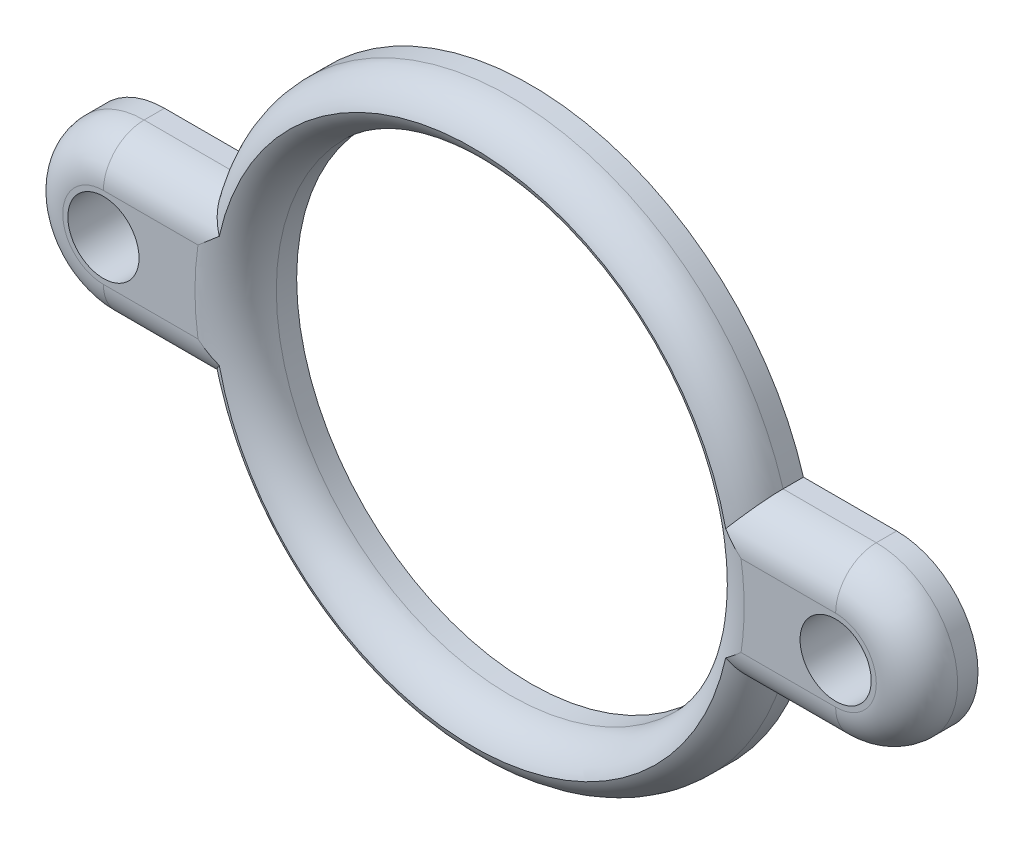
ISO-10303-21;
HEADER;
FILE_DESCRIPTION(('STEP AP214'),'2;1');
FILE_NAME('part.step','',(''),(''),'','','');
FILE_SCHEMA(('AUTOMOTIVE_DESIGN { 1 0 10303 214 1 1 1 1 }'));
ENDSEC;
DATA;
#1=APPLICATION_CONTEXT('core data for automotive mechanical design processes');
#2=APPLICATION_PROTOCOL_DEFINITION('international standard','automotive_design',2000,#1);
#3=PRODUCT_CONTEXT('',#1,'mechanical');
#4=PRODUCT('Part','Part','',(#3));
#5=PRODUCT_RELATED_PRODUCT_CATEGORY('part','',(#4));
#6=PRODUCT_DEFINITION_FORMATION('','',#4);
#7=PRODUCT_DEFINITION_CONTEXT('part definition',#1,'design');
#8=PRODUCT_DEFINITION('design','',#6,#7);
#9=PRODUCT_DEFINITION_SHAPE('','',#8);
#10=(LENGTH_UNIT() NAMED_UNIT(*) SI_UNIT(.MILLI.,.METRE.));
#11=(NAMED_UNIT(*) PLANE_ANGLE_UNIT() SI_UNIT($,.RADIAN.));
#12=(NAMED_UNIT(*) SI_UNIT($,.STERADIAN.) SOLID_ANGLE_UNIT());
#13=UNCERTAINTY_MEASURE_WITH_UNIT(LENGTH_MEASURE(1.E-05),#10,'distance_accuracy_value','');
#14=(GEOMETRIC_REPRESENTATION_CONTEXT(3) GLOBAL_UNCERTAINTY_ASSIGNED_CONTEXT((#13)) GLOBAL_UNIT_ASSIGNED_CONTEXT((#10,
#11,#12)) REPRESENTATION_CONTEXT('',''));
#15=CARTESIAN_POINT('',(0.,0.,0.));
#16=DIRECTION('',(0.,0.,1.));
#17=DIRECTION('',(1.,0.,0.));
#18=AXIS2_PLACEMENT_3D('',#15,#16,#17);
#19=CARTESIAN_POINT('',(0.,0.,3.));
#20=DIRECTION('',(0.,0.,1.));
#21=DIRECTION('',(1.,0.,0.));
#22=AXIS2_PLACEMENT_3D('',#19,#20,#21);
#23=PLANE('',#22);
#24=CARTESIAN_POINT('',(0.,0.,3.));
#25=DIRECTION('',(0.,0.,1.));
#26=DIRECTION('',(1.,0.,0.));
#27=AXIS2_PLACEMENT_3D('',#24,#25,#26);
#28=CIRCLE('',#27,13.5);
#29=CARTESIAN_POINT('',(13.3510299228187,2.00000000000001,3.));
#30=VERTEX_POINT('',#29);
#31=CARTESIAN_POINT('',(13.5,0.,3.));
#32=VERTEX_POINT('',#31);
#33=EDGE_CURVE('E377',#30,#32,#28,.F.);
#34=ORIENTED_EDGE('',*,*,#33,.T.);
#35=CARTESIAN_POINT('',(0.,0.,3.));
#36=DIRECTION('',(0.,0.,1.));
#37=DIRECTION('',(1.,0.,0.));
#38=AXIS2_PLACEMENT_3D('',#35,#36,#37);
#39=CIRCLE('',#38,13.5);
#40=CARTESIAN_POINT('',(13.3510299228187,-1.99999999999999,3.));
#41=VERTEX_POINT('',#40);
#42=EDGE_CURVE('E337',#32,#41,#39,.F.);
#43=ORIENTED_EDGE('',*,*,#42,.T.);
#44=DIRECTION('',(1.,0.,0.));
#45=VECTOR('',#44,1.);
#46=CARTESIAN_POINT('',(18.,-1.99999999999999,3.));
#47=LINE('',#46,#45);
#48=CARTESIAN_POINT('',(18.,-1.99999999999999,3.));
#49=VERTEX_POINT('',#48);
#50=EDGE_CURVE('E383',#41,#49,#47,.T.);
#51=ORIENTED_EDGE('',*,*,#50,.T.);
#52=CARTESIAN_POINT('',(18.,0.,3.));
#53=DIRECTION('',(0.,0.,1.));
#54=DIRECTION('',(1.,0.,0.));
#55=AXIS2_PLACEMENT_3D('',#52,#53,#54);
#56=CIRCLE('',#55,2.);
#57=CARTESIAN_POINT('',(18.,2.00000000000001,3.));
#58=VERTEX_POINT('',#57);
#59=EDGE_CURVE('E380',#49,#58,#56,.T.);
#60=ORIENTED_EDGE('',*,*,#59,.T.);
#61=DIRECTION('',(1.,0.,0.));
#62=VECTOR('',#61,1.);
#63=CARTESIAN_POINT('',(0.,2.,3.));
#64=LINE('',#63,#62);
#65=EDGE_CURVE('E374',#58,#30,#64,.F.);
#66=ORIENTED_EDGE('',*,*,#65,.T.);
#67=EDGE_LOOP('',(#34,#43,#51,#60,#66));
#68=FACE_BOUND('',#67,.T.);
#69=CARTESIAN_POINT('',(18.,0.,3.));
#70=DIRECTION('',(0.,0.,1.));
#71=DIRECTION('',(1.,0.,0.));
#72=AXIS2_PLACEMENT_3D('',#69,#70,#71);
#73=CIRCLE('',#72,1.75);
#74=CARTESIAN_POINT('',(19.75,0.,3.));
#75=VERTEX_POINT('',#74);
#76=EDGE_CURVE('E445',#75,#75,#73,.T.);
#77=ORIENTED_EDGE('',*,*,#76,.F.);
#78=EDGE_LOOP('',(#77));
#79=FACE_BOUND('',#78,.T.);
#80=ADVANCED_FACE('F47',(#68,#79),#23,.T.);
#81=CARTESIAN_POINT('',(18.,0.,3.));
#82=DIRECTION('',(0.,0.,-1.));
#83=DIRECTION('',(-1.,0.,0.));
#84=AXIS2_PLACEMENT_3D('',#81,#82,#83);
#85=CYLINDRICAL_SURFACE('',#84,4.);
#86=DIRECTION('',(0.,0.,-1.));
#87=VECTOR('',#86,1.);
#88=CARTESIAN_POINT('',(18.,4.00000000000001,3.));
#89=LINE('',#88,#87);
#90=CARTESIAN_POINT('',(18.,4.00000000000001,1.));
#91=VERTEX_POINT('',#90);
#92=CARTESIAN_POINT('',(18.,4.00000000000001,0.));
#93=VERTEX_POINT('',#92);
#94=EDGE_CURVE('E100',#91,#93,#89,.T.);
#95=ORIENTED_EDGE('',*,*,#94,.F.);
#96=CARTESIAN_POINT('',(18.,0.,1.));
#97=DIRECTION('',(0.,0.,1.));
#98=DIRECTION('',(1.,0.,0.));
#99=AXIS2_PLACEMENT_3D('',#96,#97,#98);
#100=CIRCLE('',#99,4.);
#101=CARTESIAN_POINT('',(18.,-3.99999999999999,1.));
#102=VERTEX_POINT('',#101);
#103=EDGE_CURVE('E336',#91,#102,#100,.F.);
#104=ORIENTED_EDGE('',*,*,#103,.T.);
#105=DIRECTION('',(0.,0.,-1.));
#106=VECTOR('',#105,1.);
#107=CARTESIAN_POINT('',(18.,-3.99999999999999,3.));
#108=LINE('',#107,#106);
#109=CARTESIAN_POINT('',(18.,-3.99999999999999,0.));
#110=VERTEX_POINT('',#109);
#111=EDGE_CURVE('E334',#102,#110,#108,.T.);
#112=ORIENTED_EDGE('',*,*,#111,.T.);
#113=CARTESIAN_POINT('',(18.,0.,0.));
#114=DIRECTION('',(0.,0.,1.));
#115=DIRECTION('',(1.,0.,0.));
#116=AXIS2_PLACEMENT_3D('',#113,#114,#115);
#117=CIRCLE('',#116,4.);
#118=EDGE_CURVE('E414',#110,#93,#117,.T.);
#119=ORIENTED_EDGE('',*,*,#118,.T.);
#120=EDGE_LOOP('',(#95,#104,#112,#119));
#121=FACE_BOUND('',#120,.T.);
#122=ADVANCED_FACE('F470',(#121),#85,.T.);
#123=CARTESIAN_POINT('',(0.,4.,3.));
#124=DIRECTION('',(0.,1.,0.));
#125=DIRECTION('',(-1.,0.,0.));
#126=AXIS2_PLACEMENT_3D('',#123,#124,#125);
#127=PLANE('',#126);
#128=DIRECTION('',(0.,0.,-1.));
#129=VECTOR('',#128,1.);
#130=CARTESIAN_POINT('',(13.4164078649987,4.00000000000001,3.));
#131=LINE('',#130,#129);
#132=CARTESIAN_POINT('',(13.4164078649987,4.00000000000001,1.));
#133=VERTEX_POINT('',#132);
#134=CARTESIAN_POINT('',(13.4164078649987,4.00000000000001,0.));
#135=VERTEX_POINT('',#134);
#136=EDGE_CURVE('E357',#133,#135,#131,.T.);
#137=ORIENTED_EDGE('',*,*,#136,.F.);
#138=DIRECTION('',(1.,0.,0.));
#139=VECTOR('',#138,1.);
#140=CARTESIAN_POINT('',(0.,4.,1.));
#141=LINE('',#140,#139);
#142=EDGE_CURVE('E207',#133,#91,#141,.T.);
#143=ORIENTED_EDGE('',*,*,#142,.T.);
#144=ORIENTED_EDGE('',*,*,#94,.T.);
#145=DIRECTION('',(1.,0.,0.));
#146=VECTOR('',#145,1.);
#147=CARTESIAN_POINT('',(0.,4.,0.));
#148=LINE('',#147,#146);
#149=EDGE_CURVE('E421',#135,#93,#148,.T.);
#150=ORIENTED_EDGE('',*,*,#149,.F.);
#151=EDGE_LOOP('',(#137,#143,#144,#150));
#152=FACE_BOUND('',#151,.T.);
#153=ADVANCED_FACE('F475',(#152),#127,.T.);
#154=CARTESIAN_POINT('',(0.,0.,3.));
#155=DIRECTION('',(0.,0.,-1.));
#156=DIRECTION('',(-1.,0.,0.));
#157=AXIS2_PLACEMENT_3D('',#154,#155,#156);
#158=CYLINDRICAL_SURFACE('',#157,14.);
#159=DIRECTION('',(0.,0.,-1.));
#160=VECTOR('',#159,1.);
#161=CARTESIAN_POINT('',(-13.4164078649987,4.,3.));
#162=LINE('',#161,#160);
#163=CARTESIAN_POINT('',(-13.4164078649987,4.,1.));
#164=VERTEX_POINT('',#163);
#165=CARTESIAN_POINT('',(-13.4164078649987,4.,0.));
#166=VERTEX_POINT('',#165);
#167=EDGE_CURVE('E185',#164,#166,#162,.T.);
#168=ORIENTED_EDGE('',*,*,#167,.F.);
#169=CARTESIAN_POINT('',(0.,0.,1.));
#170=DIRECTION('',(0.,0.,1.));
#171=DIRECTION('',(1.,0.,0.));
#172=AXIS2_PLACEMENT_3D('',#169,#170,#171);
#173=CIRCLE('',#172,14.);
#174=EDGE_CURVE('E58',#164,#133,#173,.F.);
#175=ORIENTED_EDGE('',*,*,#174,.T.);
#176=ORIENTED_EDGE('',*,*,#136,.T.);
#177=CARTESIAN_POINT('',(0.,0.,0.));
#178=DIRECTION('',(0.,0.,1.));
#179=DIRECTION('',(1.,0.,0.));
#180=AXIS2_PLACEMENT_3D('',#177,#178,#179);
#181=CIRCLE('',#180,14.);
#182=EDGE_CURVE('E425',#135,#166,#181,.T.);
#183=ORIENTED_EDGE('',*,*,#182,.T.);
#184=EDGE_LOOP('',(#168,#175,#176,#183));
#185=FACE_BOUND('',#184,.T.);
#186=ADVANCED_FACE('F489',(#185),#158,.T.);
#187=CARTESIAN_POINT('',(0.,4.,3.));
#188=DIRECTION('',(0.,1.,0.));
#189=DIRECTION('',(-1.,0.,0.));
#190=AXIS2_PLACEMENT_3D('',#187,#188,#189);
#191=PLANE('',#190);
#192=DIRECTION('',(0.,0.,-1.));
#193=VECTOR('',#192,1.);
#194=CARTESIAN_POINT('',(-18.,4.,3.));
#195=LINE('',#194,#193);
#196=CARTESIAN_POINT('',(-18.,4.,1.));
#197=VERTEX_POINT('',#196);
#198=CARTESIAN_POINT('',(-18.,4.,0.));
#199=VERTEX_POINT('',#198);
#200=EDGE_CURVE('E169',#197,#199,#195,.T.);
#201=ORIENTED_EDGE('',*,*,#200,.F.);
#202=DIRECTION('',(1.,0.,0.));
#203=VECTOR('',#202,1.);
#204=CARTESIAN_POINT('',(0.,4.,1.));
#205=LINE('',#204,#203);
#206=EDGE_CURVE('E11',#197,#164,#205,.T.);
#207=ORIENTED_EDGE('',*,*,#206,.T.);
#208=ORIENTED_EDGE('',*,*,#167,.T.);
#209=DIRECTION('',(1.,0.,0.));
#210=VECTOR('',#209,1.);
#211=CARTESIAN_POINT('',(0.,4.,0.));
#212=LINE('',#211,#210);
#213=EDGE_CURVE('E183',#199,#166,#212,.T.);
#214=ORIENTED_EDGE('',*,*,#213,.F.);
#215=EDGE_LOOP('',(#201,#207,#208,#214));
#216=FACE_BOUND('',#215,.T.);
#217=ADVANCED_FACE('F181',(#216),#191,.T.);
#218=CARTESIAN_POINT('',(-18.,0.,3.));
#219=DIRECTION('',(0.,0.,-1.));
#220=DIRECTION('',(-1.,0.,0.));
#221=AXIS2_PLACEMENT_3D('',#218,#219,#220);
#222=CYLINDRICAL_SURFACE('',#221,4.);
#223=DIRECTION('',(0.,0.,-1.));
#224=VECTOR('',#223,1.);
#225=CARTESIAN_POINT('',(-18.,-4.,3.));
#226=LINE('',#225,#224);
#227=CARTESIAN_POINT('',(-18.,-4.,1.));
#228=VERTEX_POINT('',#227);
#229=CARTESIAN_POINT('',(-18.,-4.,0.));
#230=VERTEX_POINT('',#229);
#231=EDGE_CURVE('E171',#228,#230,#226,.T.);
#232=ORIENTED_EDGE('',*,*,#231,.F.);
#233=CARTESIAN_POINT('',(-18.,0.,1.));
#234=DIRECTION('',(0.,0.,1.));
#235=DIRECTION('',(1.,0.,0.));
#236=AXIS2_PLACEMENT_3D('',#233,#234,#235);
#237=CIRCLE('',#236,4.);
#238=EDGE_CURVE('E166',#228,#197,#237,.F.);
#239=ORIENTED_EDGE('',*,*,#238,.T.);
#240=ORIENTED_EDGE('',*,*,#200,.T.);
#241=CARTESIAN_POINT('',(-18.,0.,0.));
#242=DIRECTION('',(0.,0.,1.));
#243=DIRECTION('',(1.,0.,0.));
#244=AXIS2_PLACEMENT_3D('',#241,#242,#243);
#245=CIRCLE('',#244,4.);
#246=EDGE_CURVE('E431',#199,#230,#245,.T.);
#247=ORIENTED_EDGE('',*,*,#246,.T.);
#248=EDGE_LOOP('',(#232,#239,#240,#247));
#249=FACE_BOUND('',#248,.T.);
#250=ADVANCED_FACE('F167',(#249),#222,.T.);
#251=CARTESIAN_POINT('',(0.,-4.,3.));
#252=DIRECTION('',(0.,1.,0.));
#253=DIRECTION('',(-1.,0.,0.));
#254=AXIS2_PLACEMENT_3D('',#251,#252,#253);
#255=PLANE('',#254);
#256=DIRECTION('',(0.,0.,-1.));
#257=VECTOR('',#256,1.);
#258=CARTESIAN_POINT('',(-13.4164078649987,-4.,3.));
#259=LINE('',#258,#257);
#260=CARTESIAN_POINT('',(-13.4164078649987,-4.,1.));
#261=VERTEX_POINT('',#260);
#262=CARTESIAN_POINT('',(-13.4164078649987,-4.,0.));
#263=VERTEX_POINT('',#262);
#264=EDGE_CURVE('E344',#261,#263,#259,.T.);
#265=ORIENTED_EDGE('',*,*,#264,.F.);
#266=DIRECTION('',(1.,0.,0.));
#267=VECTOR('',#266,1.);
#268=CARTESIAN_POINT('',(-18.,-4.,1.));
#269=LINE('',#268,#267);
#270=EDGE_CURVE('E178',#261,#228,#269,.F.);
#271=ORIENTED_EDGE('',*,*,#270,.T.);
#272=ORIENTED_EDGE('',*,*,#231,.T.);
#273=DIRECTION('',(1.,0.,0.));
#274=VECTOR('',#273,1.);
#275=CARTESIAN_POINT('',(0.,-4.,0.));
#276=LINE('',#275,#274);
#277=EDGE_CURVE('E434',#230,#263,#276,.T.);
#278=ORIENTED_EDGE('',*,*,#277,.T.);
#279=EDGE_LOOP('',(#265,#271,#272,#278));
#280=FACE_BOUND('',#279,.T.);
#281=ADVANCED_FACE('F520',(#280),#255,.F.);
#282=CARTESIAN_POINT('',(0.,0.,3.));
#283=DIRECTION('',(0.,0.,-1.));
#284=DIRECTION('',(-1.,0.,0.));
#285=AXIS2_PLACEMENT_3D('',#282,#283,#284);
#286=CYLINDRICAL_SURFACE('',#285,14.);
#287=DIRECTION('',(0.,0.,-1.));
#288=VECTOR('',#287,1.);
#289=CARTESIAN_POINT('',(13.4164078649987,-3.99999999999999,3.));
#290=LINE('',#289,#288);
#291=CARTESIAN_POINT('',(13.4164078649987,-3.99999999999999,1.));
#292=VERTEX_POINT('',#291);
#293=CARTESIAN_POINT('',(13.4164078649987,-3.99999999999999,0.));
#294=VERTEX_POINT('',#293);
#295=EDGE_CURVE('E332',#292,#294,#290,.T.);
#296=ORIENTED_EDGE('',*,*,#295,.F.);
#297=CARTESIAN_POINT('',(0.,0.,1.));
#298=DIRECTION('',(0.,0.,1.));
#299=DIRECTION('',(1.,0.,0.));
#300=AXIS2_PLACEMENT_3D('',#297,#298,#299);
#301=CIRCLE('',#300,14.);
#302=EDGE_CURVE('E210',#292,#261,#301,.F.);
#303=ORIENTED_EDGE('',*,*,#302,.T.);
#304=ORIENTED_EDGE('',*,*,#264,.T.);
#305=CARTESIAN_POINT('',(0.,0.,0.));
#306=DIRECTION('',(0.,0.,1.));
#307=DIRECTION('',(1.,0.,0.));
#308=AXIS2_PLACEMENT_3D('',#305,#306,#307);
#309=CIRCLE('',#308,14.);
#310=EDGE_CURVE('E341',#263,#294,#309,.T.);
#311=ORIENTED_EDGE('',*,*,#310,.T.);
#312=EDGE_LOOP('',(#296,#303,#304,#311));
#313=FACE_BOUND('',#312,.T.);
#314=ADVANCED_FACE('F339',(#313),#286,.T.);
#315=CARTESIAN_POINT('',(0.,-4.,3.));
#316=DIRECTION('',(0.,1.,0.));
#317=DIRECTION('',(-1.,0.,0.));
#318=AXIS2_PLACEMENT_3D('',#315,#316,#317);
#319=PLANE('',#318);
#320=ORIENTED_EDGE('',*,*,#111,.F.);
#321=DIRECTION('',(1.,0.,0.));
#322=VECTOR('',#321,1.);
#323=CARTESIAN_POINT('',(13.4164078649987,-3.99999999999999,1.));
#324=LINE('',#323,#322);
#325=EDGE_CURVE('E320',#102,#292,#324,.F.);
#326=ORIENTED_EDGE('',*,*,#325,.T.);
#327=ORIENTED_EDGE('',*,*,#295,.T.);
#328=DIRECTION('',(1.,0.,0.));
#329=VECTOR('',#328,1.);
#330=CARTESIAN_POINT('',(0.,-4.,0.));
#331=LINE('',#330,#329);
#332=EDGE_CURVE('E440',#294,#110,#331,.T.);
#333=ORIENTED_EDGE('',*,*,#332,.T.);
#334=EDGE_LOOP('',(#320,#326,#327,#333));
#335=FACE_BOUND('',#334,.T.);
#336=ADVANCED_FACE('F330',(#335),#319,.F.);
#337=CARTESIAN_POINT('',(18.,0.,3.));
#338=DIRECTION('',(0.,0.,-1.));
#339=DIRECTION('',(-1.,0.,0.));
#340=AXIS2_PLACEMENT_3D('',#337,#338,#339);
#341=CYLINDRICAL_SURFACE('',#340,1.75);
#342=ORIENTED_EDGE('',*,*,#76,.T.);
#343=EDGE_LOOP('',(#342));
#344=FACE_BOUND('',#343,.T.);
#345=CARTESIAN_POINT('',(18.,0.,0.));
#346=DIRECTION('',(0.,0.,1.));
#347=DIRECTION('',(1.,0.,0.));
#348=AXIS2_PLACEMENT_3D('',#345,#346,#347);
#349=CIRCLE('',#348,1.75);
#350=CARTESIAN_POINT('',(19.75,0.,0.));
#351=VERTEX_POINT('',#350);
#352=EDGE_CURVE('E408',#351,#351,#349,.T.);
#353=ORIENTED_EDGE('',*,*,#352,.F.);
#354=EDGE_LOOP('',(#353));
#355=FACE_BOUND('',#354,.T.);
#356=ADVANCED_FACE('F500',(#344,#355),#341,.F.);
#357=CARTESIAN_POINT('',(0.,0.,3.));
#358=DIRECTION('',(0.,0.,-1.));
#359=DIRECTION('',(-1.,0.,0.));
#360=AXIS2_PLACEMENT_3D('',#357,#358,#359);
#361=CYLINDRICAL_SURFACE('',#360,11.5);
#362=CARTESIAN_POINT('',(0.,0.,1.));
#363=DIRECTION('',(0.,0.,1.));
#364=DIRECTION('',(1.,0.,0.));
#365=AXIS2_PLACEMENT_3D('',#362,#363,#364);
#366=CIRCLE('',#365,11.5);
#367=CARTESIAN_POINT('',(11.5,0.,1.));
#368=VERTEX_POINT('',#367);
#369=EDGE_CURVE('E177',#368,#368,#366,.T.);
#370=ORIENTED_EDGE('',*,*,#369,.T.);
#371=EDGE_LOOP('',(#370));
#372=FACE_BOUND('',#371,.T.);
#373=CARTESIAN_POINT('',(0.,0.,0.));
#374=DIRECTION('',(0.,0.,1.));
#375=DIRECTION('',(1.,0.,0.));
#376=AXIS2_PLACEMENT_3D('',#373,#374,#375);
#377=CIRCLE('',#376,11.5);
#378=CARTESIAN_POINT('',(11.5,0.,0.));
#379=VERTEX_POINT('',#378);
#380=EDGE_CURVE('E405',#379,#379,#377,.T.);
#381=ORIENTED_EDGE('',*,*,#380,.F.);
#382=EDGE_LOOP('',(#381));
#383=FACE_BOUND('',#382,.T.);
#384=ADVANCED_FACE('F397',(#372,#383),#361,.F.);
#385=CARTESIAN_POINT('',(-18.,0.,3.));
#386=DIRECTION('',(0.,0.,-1.));
#387=DIRECTION('',(-1.,0.,0.));
#388=AXIS2_PLACEMENT_3D('',#385,#386,#387);
#389=CYLINDRICAL_SURFACE('',#388,1.75);
#390=CARTESIAN_POINT('',(-18.,0.,3.));
#391=DIRECTION('',(0.,0.,1.));
#392=DIRECTION('',(1.,0.,0.));
#393=AXIS2_PLACEMENT_3D('',#390,#391,#392);
#394=CIRCLE('',#393,1.75);
#395=CARTESIAN_POINT('',(-16.25,0.,3.));
#396=VERTEX_POINT('',#395);
#397=EDGE_CURVE('E349',#396,#396,#394,.T.);
#398=ORIENTED_EDGE('',*,*,#397,.T.);
#399=EDGE_LOOP('',(#398));
#400=FACE_BOUND('',#399,.T.);
#401=CARTESIAN_POINT('',(-18.,0.,0.));
#402=DIRECTION('',(0.,0.,1.));
#403=DIRECTION('',(1.,0.,0.));
#404=AXIS2_PLACEMENT_3D('',#401,#402,#403);
#405=CIRCLE('',#404,1.75);
#406=CARTESIAN_POINT('',(-16.25,0.,0.));
#407=VERTEX_POINT('',#406);
#408=EDGE_CURVE('E442',#407,#407,#405,.T.);
#409=ORIENTED_EDGE('',*,*,#408,.F.);
#410=EDGE_LOOP('',(#409));
#411=FACE_BOUND('',#410,.T.);
#412=ADVANCED_FACE('F456',(#400,#411),#389,.F.);
#413=CARTESIAN_POINT('',(-18.,0.,3.));
#414=DIRECTION('',(0.,0.,1.));
#415=DIRECTION('',(1.,0.,0.));
#416=AXIS2_PLACEMENT_3D('',#413,#414,#415);
#417=CIRCLE('',#416,2.);
#418=CARTESIAN_POINT('',(-18.,2.,3.));
#419=VERTEX_POINT('',#418);
#420=CARTESIAN_POINT('',(-18.,-2.,3.));
#421=VERTEX_POINT('',#420);
#422=EDGE_CURVE('E190',#419,#421,#417,.T.);
#423=ORIENTED_EDGE('',*,*,#422,.T.);
#424=DIRECTION('',(1.,0.,0.));
#425=VECTOR('',#424,1.);
#426=CARTESIAN_POINT('',(-13.4164078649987,-2.,3.));
#427=LINE('',#426,#425);
#428=CARTESIAN_POINT('',(-13.3510299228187,-2.,3.));
#429=VERTEX_POINT('',#428);
#430=EDGE_CURVE('E370',#421,#429,#427,.T.);
#431=ORIENTED_EDGE('',*,*,#430,.T.);
#432=CARTESIAN_POINT('',(0.,0.,3.));
#433=DIRECTION('',(0.,0.,1.));
#434=DIRECTION('',(1.,0.,0.));
#435=AXIS2_PLACEMENT_3D('',#432,#433,#434);
#436=CIRCLE('',#435,13.5);
#437=CARTESIAN_POINT('',(-13.3510299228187,2.,3.));
#438=VERTEX_POINT('',#437);
#439=EDGE_CURVE('E365',#429,#438,#436,.F.);
#440=ORIENTED_EDGE('',*,*,#439,.T.);
#441=DIRECTION('',(1.,0.,0.));
#442=VECTOR('',#441,1.);
#443=CARTESIAN_POINT('',(0.,2.,3.));
#444=LINE('',#443,#442);
#445=EDGE_CURVE('E362',#438,#419,#444,.F.);
#446=ORIENTED_EDGE('',*,*,#445,.T.);
#447=EDGE_LOOP('',(#423,#431,#440,#446));
#448=FACE_BOUND('',#447,.T.);
#449=ORIENTED_EDGE('',*,*,#397,.F.);
#450=EDGE_LOOP('',(#449));
#451=FACE_BOUND('',#450,.T.);
#452=ADVANCED_FACE('F402',(#448,#451),#23,.T.);
#453=CARTESIAN_POINT('',(0.,0.,0.));
#454=DIRECTION('',(0.,0.,1.));
#455=DIRECTION('',(1.,0.,0.));
#456=AXIS2_PLACEMENT_3D('',#453,#454,#455);
#457=PLANE('',#456);
#458=ORIENTED_EDGE('',*,*,#380,.T.);
#459=EDGE_LOOP('',(#458));
#460=FACE_BOUND('',#459,.T.);
#461=ORIENTED_EDGE('',*,*,#352,.T.);
#462=EDGE_LOOP('',(#461));
#463=FACE_BOUND('',#462,.T.);
#464=ORIENTED_EDGE('',*,*,#118,.F.);
#465=ORIENTED_EDGE('',*,*,#332,.F.);
#466=ORIENTED_EDGE('',*,*,#310,.F.);
#467=ORIENTED_EDGE('',*,*,#277,.F.);
#468=ORIENTED_EDGE('',*,*,#246,.F.);
#469=ORIENTED_EDGE('',*,*,#213,.T.);
#470=ORIENTED_EDGE('',*,*,#182,.F.);
#471=ORIENTED_EDGE('',*,*,#149,.T.);
#472=EDGE_LOOP('',(#464,#465,#466,#467,#468,#469,#470,#471));
#473=FACE_BOUND('',#472,.T.);
#474=ORIENTED_EDGE('',*,*,#408,.T.);
#475=EDGE_LOOP('',(#474));
#476=FACE_BOUND('',#475,.T.);
#477=ADVANCED_FACE('F459',(#460,#463,#473,#476),#457,.F.);
#478=CARTESIAN_POINT('',(-18.,0.,1.));
#479=DIRECTION('',(0.,0.,1.));
#480=DIRECTION('',(1.,0.,0.));
#481=AXIS2_PLACEMENT_3D('',#478,#479,#480);
#482=DEGENERATE_TOROIDAL_SURFACE('',#481,2.,2.,.T.);
#483=CARTESIAN_POINT('',(-18.,2.,1.));
#484=DIRECTION('',(1.,0.,0.));
#485=DIRECTION('',(0.,0.,-1.));
#486=AXIS2_PLACEMENT_3D('',#483,#484,#485);
#487=CIRCLE('',#486,2.);
#488=EDGE_CURVE('E189',#197,#419,#487,.T.);
#489=ORIENTED_EDGE('',*,*,#488,.F.);
#490=ORIENTED_EDGE('',*,*,#238,.F.);
#491=CARTESIAN_POINT('',(-18.,-2.,1.));
#492=DIRECTION('',(1.,0.,0.));
#493=DIRECTION('',(0.,0.,-1.));
#494=AXIS2_PLACEMENT_3D('',#491,#492,#493);
#495=CIRCLE('',#494,2.);
#496=EDGE_CURVE('E51',#421,#228,#495,.T.);
#497=ORIENTED_EDGE('',*,*,#496,.F.);
#498=ORIENTED_EDGE('',*,*,#422,.F.);
#499=EDGE_LOOP('',(#489,#490,#497,#498));
#500=FACE_BOUND('',#499,.T.);
#501=ADVANCED_FACE('F49',(#500),#482,.T.);
#502=CARTESIAN_POINT('',(0.,-2.,1.));
#503=DIRECTION('',(-1.,0.,0.));
#504=DIRECTION('',(0.,-1.,0.));
#505=AXIS2_PLACEMENT_3D('',#502,#503,#504);
#506=CYLINDRICAL_SURFACE('',#505,2.);
#507=ORIENTED_EDGE('',*,*,#496,.T.);
#508=ORIENTED_EDGE('',*,*,#270,.F.);
#509=CARTESIAN_POINT('',(-13.4164078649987,-4.,1.));
#510=CARTESIAN_POINT('',(-13.416414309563,-4.00000968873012,1.04819069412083));
#511=CARTESIAN_POINT('',(-13.4151098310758,-3.99825852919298,1.09637547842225));
#512=CARTESIAN_POINT('',(-13.4099285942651,-3.99130863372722,1.19233521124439));
#513=CARTESIAN_POINT('',(-13.4060530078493,-3.98611146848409,1.24011033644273));
#514=CARTESIAN_POINT('',(-13.395807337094,-3.97238147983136,1.33463624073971));
#515=CARTESIAN_POINT('',(-13.3894511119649,-3.96386718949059,1.38139121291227));
#516=CARTESIAN_POINT('',(-13.3743393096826,-3.94364475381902,1.47379906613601));
#517=CARTESIAN_POINT('',(-13.3655835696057,-3.93193639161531,1.51945187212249));
#518=CARTESIAN_POINT('',(-13.3359080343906,-3.89230243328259,1.65415475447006));
#519=CARTESIAN_POINT('',(-13.3115549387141,-3.85983432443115,1.741173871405));
#520=CARTESIAN_POINT('',(-13.2548263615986,-3.78448106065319,1.90775470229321));
#521=CARTESIAN_POINT('',(-13.2224418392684,-3.74158416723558,1.98730787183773));
#522=CARTESIAN_POINT('',(-13.148536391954,-3.64412803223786,2.14271232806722));
#523=CARTESIAN_POINT('',(-13.1065556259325,-3.58898852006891,2.21797884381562));
#524=CARTESIAN_POINT('',(-13.0163151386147,-3.47112090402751,2.35801229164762));
#525=CARTESIAN_POINT('',(-12.968052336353,-3.40838907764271,2.42277403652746));
#526=CARTESIAN_POINT('',(-12.8437315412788,-3.24780311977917,2.56824676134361));
#527=CARTESIAN_POINT('',(-12.7648988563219,-3.14679246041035,2.64312955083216));
#528=CARTESIAN_POINT('',(-12.5996945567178,-2.93727251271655,2.77105752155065));
#529=CARTESIAN_POINT('',(-12.5133077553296,-2.82874821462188,2.82405742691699));
#530=CARTESIAN_POINT('',(-12.3307177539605,-2.60189130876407,2.9113556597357));
#531=CARTESIAN_POINT('',(-12.2342365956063,-2.48334471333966,2.94449996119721));
#532=CARTESIAN_POINT('',(-12.0380319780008,-2.24523082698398,2.98858760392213));
#533=CARTESIAN_POINT('',(-11.9383161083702,-2.12566635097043,2.99957956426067));
#534=CARTESIAN_POINT('',(-11.8360354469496,-2.00458656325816,2.99999605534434));
#535=CARTESIAN_POINT('',(-11.834097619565,-2.00229313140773,2.99999999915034));
#536=CARTESIAN_POINT('',(-11.8321595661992,-2.,3.));
#537=B_SPLINE_CURVE_WITH_KNOTS('',3,(#509,#510,#511,#512,#513,#514,#515,#516,#517,#518,#519,
#520,#521,#522,#523,#524,#525,#526,#527,#528,#529,#530,#531,#532,#533,#534,#535,#536),
.UNSPECIFIED.,.F.,.F.,(4,2,2,2,2,2,2,2,2,2,2,2,2,4),(0.,0.144512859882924,0.28895989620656,
0.432611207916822,0.576272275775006,0.862917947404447,1.14988776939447,1.4556743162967,
1.76161140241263,2.20443005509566,2.64816036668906,3.11566288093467,3.5821382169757,
3.59114571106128),.UNSPECIFIED.);
#538=CARTESIAN_POINT('',(-12.4498995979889,-2.74999999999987,2.85404962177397));
#539=VERTEX_POINT('',#538);
#540=EDGE_CURVE('E91',#539,#261,#537,.F.);
#541=ORIENTED_EDGE('',*,*,#540,.F.);
#542=CARTESIAN_POINT('',(-11.680963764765,-3.34855114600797,2.47695964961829));
#543=CARTESIAN_POINT('',(-11.7211327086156,-3.31827996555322,2.50459319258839));
#544=CARTESIAN_POINT('',(-11.7617559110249,-3.28750912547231,2.53098889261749));
#545=CARTESIAN_POINT('',(-11.8437592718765,-3.22506592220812,2.58140032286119));
#546=CARTESIAN_POINT('',(-11.8851392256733,-3.19339380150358,2.60541668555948));
#547=CARTESIAN_POINT('',(-12.0101392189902,-3.09720929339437,2.67401725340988));
#548=CARTESIAN_POINT('',(-12.0946972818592,-3.03147012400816,2.71520574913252));
#549=CARTESIAN_POINT('',(-12.265190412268,-2.89749554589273,2.78894771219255));
#550=CARTESIAN_POINT('',(-12.3511219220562,-2.82926613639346,2.8215205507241));
#551=CARTESIAN_POINT('',(-12.5239178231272,-2.69061124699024,2.87847576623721));
#552=CARTESIAN_POINT('',(-12.6107822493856,-2.62018568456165,2.90285783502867));
#553=CARTESIAN_POINT('',(-12.8055844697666,-2.4606002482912,2.94840345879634));
#554=CARTESIAN_POINT('',(-12.9136312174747,-2.37096070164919,2.96743004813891));
#555=CARTESIAN_POINT('',(-13.1293889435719,-2.18970222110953,2.99308218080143));
#556=CARTESIAN_POINT('',(-13.237100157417,-2.09808550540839,2.99972095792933));
#557=CARTESIAN_POINT('',(-13.3464866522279,-2.00391287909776,2.99999712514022));
#558=CARTESIAN_POINT('',(-13.3487584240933,-2.00195657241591,2.99999999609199));
#559=CARTESIAN_POINT('',(-13.3510299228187,-2.,3.));
#560=B_SPLINE_CURVE_WITH_KNOTS('',3,(#542,#543,#544,#545,#546,#547,#548,#549,#550,#551,#552,
#553,#554,#555,#556,#557,#558,#559),.UNSPECIFIED.,.F.,.F.,(4,2,2,2,2,2,2,2,4),(0.,
0.172125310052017,0.344204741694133,0.688032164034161,1.03107983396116,1.3741404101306,
1.79861451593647,2.22263489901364,2.23162893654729),.UNSPECIFIED.);
#561=EDGE_CURVE('E279',#429,#539,#560,.F.);
#562=ORIENTED_EDGE('',*,*,#561,.F.);
#563=ORIENTED_EDGE('',*,*,#430,.F.);
#564=EDGE_LOOP('',(#507,#508,#541,#562,#563));
#565=FACE_BOUND('',#564,.T.);
#566=ADVANCED_FACE('F270',(#565),#506,.T.);
#567=CARTESIAN_POINT('',(0.,2.,1.));
#568=DIRECTION('',(1.,0.,0.));
#569=DIRECTION('',(0.,1.,0.));
#570=AXIS2_PLACEMENT_3D('',#567,#568,#569);
#571=CYLINDRICAL_SURFACE('',#570,2.);
#572=CARTESIAN_POINT('',(-13.4164078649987,4.,1.));
#573=CARTESIAN_POINT('',(-13.416414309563,4.00000968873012,1.04819069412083));
#574=CARTESIAN_POINT('',(-13.4151098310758,3.99825852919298,1.09637547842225));
#575=CARTESIAN_POINT('',(-13.4099285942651,3.99130863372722,1.19233521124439));
#576=CARTESIAN_POINT('',(-13.4060530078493,3.98611146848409,1.24011033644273));
#577=CARTESIAN_POINT('',(-13.395807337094,3.97238147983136,1.33463624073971));
#578=CARTESIAN_POINT('',(-13.3894511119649,3.96386718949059,1.38139121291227));
#579=CARTESIAN_POINT('',(-13.3743393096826,3.94364475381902,1.47379906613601));
#580=CARTESIAN_POINT('',(-13.3655835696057,3.93193639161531,1.51945187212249));
#581=CARTESIAN_POINT('',(-13.3359080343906,3.89230243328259,1.65415475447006));
#582=CARTESIAN_POINT('',(-13.3115549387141,3.85983432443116,1.741173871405));
#583=CARTESIAN_POINT('',(-13.2548263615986,3.7844810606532,1.90775470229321));
#584=CARTESIAN_POINT('',(-13.2224418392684,3.74158416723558,1.98730787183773));
#585=CARTESIAN_POINT('',(-13.148536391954,3.64412803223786,2.14271232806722));
#586=CARTESIAN_POINT('',(-13.1065556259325,3.58898852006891,2.21797884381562));
#587=CARTESIAN_POINT('',(-13.0163151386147,3.47112090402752,2.35801229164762));
#588=CARTESIAN_POINT('',(-12.968052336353,3.40838907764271,2.42277403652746));
#589=CARTESIAN_POINT('',(-12.8437315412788,3.24780311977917,2.5682467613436));
#590=CARTESIAN_POINT('',(-12.7648988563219,3.14679246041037,2.64312955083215));
#591=CARTESIAN_POINT('',(-12.5996945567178,2.93727251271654,2.77105752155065));
#592=CARTESIAN_POINT('',(-12.5133077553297,2.82874821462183,2.82405742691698));
#593=CARTESIAN_POINT('',(-12.3307177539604,2.60189130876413,2.9113556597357));
#594=CARTESIAN_POINT('',(-12.234236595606,2.48334471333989,2.94449996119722));
#595=CARTESIAN_POINT('',(-12.038031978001,2.24523082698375,2.98858760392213));
#596=CARTESIAN_POINT('',(-11.9383161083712,2.12566635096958,2.99957956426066));
#597=CARTESIAN_POINT('',(-11.8360354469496,2.00458656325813,2.99999605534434));
#598=CARTESIAN_POINT('',(-11.834097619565,2.00229313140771,2.99999999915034));
#599=CARTESIAN_POINT('',(-11.8321595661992,2.,3.));
#600=B_SPLINE_CURVE_WITH_KNOTS('',3,(#572,#573,#574,#575,#576,#577,#578,#579,#580,#581,#582,
#583,#584,#585,#586,#587,#588,#589,#590,#591,#592,#593,#594,#595,#596,#597,#598,#599),
.UNSPECIFIED.,.F.,.F.,(4,2,2,2,2,2,2,2,2,2,2,2,2,4),(0.,0.144512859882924,0.28895989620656,
0.432611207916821,0.576272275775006,0.862917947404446,1.14988776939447,1.4556743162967,
1.76161140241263,2.20443005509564,2.64816036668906,3.11566288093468,3.58213821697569,
3.59114571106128),.UNSPECIFIED.);
#601=CARTESIAN_POINT('',(-12.4498995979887,2.75000000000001,2.85404962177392));
#602=VERTEX_POINT('',#601);
#603=EDGE_CURVE('E83',#164,#602,#600,.T.);
#604=ORIENTED_EDGE('',*,*,#603,.F.);
#605=ORIENTED_EDGE('',*,*,#206,.F.);
#606=ORIENTED_EDGE('',*,*,#488,.T.);
#607=ORIENTED_EDGE('',*,*,#445,.F.);
#608=CARTESIAN_POINT('',(-11.680963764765,3.34855114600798,2.47695964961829));
#609=CARTESIAN_POINT('',(-11.7211327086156,3.31827996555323,2.50459319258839));
#610=CARTESIAN_POINT('',(-11.7617559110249,3.28750912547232,2.53098889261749));
#611=CARTESIAN_POINT('',(-11.8437592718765,3.22506592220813,2.58140032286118));
#612=CARTESIAN_POINT('',(-11.8851392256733,3.19339380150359,2.60541668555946));
#613=CARTESIAN_POINT('',(-12.0101392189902,3.0972092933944,2.67401725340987));
#614=CARTESIAN_POINT('',(-12.0946972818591,3.0314701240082,2.7152057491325));
#615=CARTESIAN_POINT('',(-12.265190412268,2.89749554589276,2.78894771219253));
#616=CARTESIAN_POINT('',(-12.3511219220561,2.82926613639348,2.82152055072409));
#617=CARTESIAN_POINT('',(-12.5239178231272,2.69061124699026,2.87847576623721));
#618=CARTESIAN_POINT('',(-12.6107822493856,2.62018568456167,2.90285783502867));
#619=CARTESIAN_POINT('',(-12.8055844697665,2.46060024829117,2.94840345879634));
#620=CARTESIAN_POINT('',(-12.9136312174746,2.37096070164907,2.96743004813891));
#621=CARTESIAN_POINT('',(-13.129388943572,2.18970222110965,2.99308218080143));
#622=CARTESIAN_POINT('',(-13.2371001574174,2.09808550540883,2.99972095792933));
#623=CARTESIAN_POINT('',(-13.3464866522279,2.00391287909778,2.99999712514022));
#624=CARTESIAN_POINT('',(-13.3487584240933,2.00195657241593,2.99999999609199));
#625=CARTESIAN_POINT('',(-13.3510299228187,2.,3.));
#626=B_SPLINE_CURVE_WITH_KNOTS('',3,(#608,#609,#610,#611,#612,#613,#614,#615,#616,#617,#618,
#619,#620,#621,#622,#623,#624,#625),.UNSPECIFIED.,.F.,.F.,(4,2,2,2,2,2,2,2,4),(0.,
0.172125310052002,0.344204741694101,0.688032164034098,1.03107983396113,1.3741404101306,
1.79861451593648,2.22263489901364,2.23162893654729),.UNSPECIFIED.);
#627=EDGE_CURVE('E196',#602,#438,#626,.T.);
#628=ORIENTED_EDGE('',*,*,#627,.F.);
#629=EDGE_LOOP('',(#604,#605,#606,#607,#628));
#630=FACE_BOUND('',#629,.T.);
#631=ADVANCED_FACE('F194',(#630),#571,.T.);
#632=CARTESIAN_POINT('',(0.,0.,1.));
#633=DIRECTION('',(0.,0.,1.));
#634=DIRECTION('',(1.,0.,0.));
#635=AXIS2_PLACEMENT_3D('',#632,#633,#634);
#636=TOROIDAL_SURFACE('',#635,12.,2.);
#637=CARTESIAN_POINT('',(13.4164078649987,4.00000000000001,1.));
#638=CARTESIAN_POINT('',(13.416414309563,4.00000968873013,1.04819069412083));
#639=CARTESIAN_POINT('',(13.4151098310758,3.99825852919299,1.09637547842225));
#640=CARTESIAN_POINT('',(13.4099285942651,3.99130863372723,1.19233521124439));
#641=CARTESIAN_POINT('',(13.4060530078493,3.9861114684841,1.24011033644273));
#642=CARTESIAN_POINT('',(13.395807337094,3.97238147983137,1.33463624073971));
#643=CARTESIAN_POINT('',(13.3894511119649,3.96386718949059,1.38139121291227));
#644=CARTESIAN_POINT('',(13.3743393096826,3.94364475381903,1.47379906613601));
#645=CARTESIAN_POINT('',(13.3655835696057,3.93193639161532,1.51945187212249));
#646=CARTESIAN_POINT('',(13.3359080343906,3.89230243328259,1.65415475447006));
#647=CARTESIAN_POINT('',(13.3115549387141,3.85983432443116,1.741173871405));
#648=CARTESIAN_POINT('',(13.2548263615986,3.7844810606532,1.90775470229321));
#649=CARTESIAN_POINT('',(13.2224418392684,3.74158416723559,1.98730787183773));
#650=CARTESIAN_POINT('',(13.148536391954,3.64412803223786,2.14271232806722));
#651=CARTESIAN_POINT('',(13.1065556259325,3.58898852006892,2.21797884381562));
#652=CARTESIAN_POINT('',(13.0163151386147,3.47112090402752,2.35801229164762));
#653=CARTESIAN_POINT('',(12.968052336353,3.40838907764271,2.42277403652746));
#654=CARTESIAN_POINT('',(12.8437315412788,3.24780311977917,2.56824676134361));
#655=CARTESIAN_POINT('',(12.7648988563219,3.14679246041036,2.64312955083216));
#656=CARTESIAN_POINT('',(12.5996945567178,2.93727251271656,2.77105752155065));
#657=CARTESIAN_POINT('',(12.5133077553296,2.82874821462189,2.82405742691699));
#658=CARTESIAN_POINT('',(12.3307177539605,2.60189130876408,2.9113556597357));
#659=CARTESIAN_POINT('',(12.2342365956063,2.48334471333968,2.94449996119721));
#660=CARTESIAN_POINT('',(12.0380319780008,2.24523082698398,2.98858760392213));
#661=CARTESIAN_POINT('',(11.9383161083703,2.12566635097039,2.99957956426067));
#662=CARTESIAN_POINT('',(11.8360354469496,2.00458656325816,2.99999605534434));
#663=CARTESIAN_POINT('',(11.834097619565,2.00229313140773,2.99999999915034));
#664=CARTESIAN_POINT('',(11.8321595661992,2.,3.));
#665=B_SPLINE_CURVE_WITH_KNOTS('',3,(#637,#638,#639,#640,#641,#642,#643,#644,#645,#646,#647,
#648,#649,#650,#651,#652,#653,#654,#655,#656,#657,#658,#659,#660,#661,#662,#663,#664),
.UNSPECIFIED.,.F.,.F.,(4,2,2,2,2,2,2,2,2,2,2,2,2,4),(0.,0.144512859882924,0.28895989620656,
0.432611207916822,0.576272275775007,0.862917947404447,1.14988776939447,1.4556743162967,
1.76161140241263,2.20443005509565,2.64816036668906,3.11566288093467,3.58213821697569,
3.59114571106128),.UNSPECIFIED.);
#666=CARTESIAN_POINT('',(12.4498995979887,2.75,2.85404962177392));
#667=VERTEX_POINT('',#666);
#668=EDGE_CURVE('E199',#133,#667,#665,.T.);
#669=ORIENTED_EDGE('',*,*,#668,.F.);
#670=ORIENTED_EDGE('',*,*,#174,.F.);
#671=ORIENTED_EDGE('',*,*,#603,.T.);
#672=CARTESIAN_POINT('',(0.,0.,2.85404962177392));
#673=DIRECTION('',(0.,0.,1.));
#674=DIRECTION('',(1.,0.,0.));
#675=AXIS2_PLACEMENT_3D('',#672,#673,#674);
#676=CIRCLE('',#675,12.75);
#677=EDGE_CURVE('E293',#667,#602,#676,.T.);
#678=ORIENTED_EDGE('',*,*,#677,.F.);
#679=EDGE_LOOP('',(#669,#670,#671,#678));
#680=FACE_BOUND('',#679,.T.);
#681=ADVANCED_FACE('F202',(#680),#636,.T.);
#682=CARTESIAN_POINT('',(0.,2.,1.));
#683=DIRECTION('',(1.,0.,0.));
#684=DIRECTION('',(0.,1.,0.));
#685=AXIS2_PLACEMENT_3D('',#682,#683,#684);
#686=CYLINDRICAL_SURFACE('',#685,2.);
#687=ORIENTED_EDGE('',*,*,#142,.F.);
#688=ORIENTED_EDGE('',*,*,#668,.T.);
#689=CARTESIAN_POINT('',(13.3510299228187,2.,3.));
#690=CARTESIAN_POINT('',(13.3487584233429,2.00195657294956,2.99999999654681));
#691=CARTESIAN_POINT('',(13.3464866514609,2.00391287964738,2.99999712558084));
#692=CARTESIAN_POINT('',(13.2431914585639,2.09284140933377,2.99973631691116));
#693=CARTESIAN_POINT('',(13.1416390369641,2.17927919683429,2.99381575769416));
#694=CARTESIAN_POINT('',(12.9382574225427,2.35038210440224,2.97096152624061));
#695=CARTESIAN_POINT('',(12.8364281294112,2.43504644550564,2.95402311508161));
#696=CARTESIAN_POINT('',(12.6330913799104,2.60210800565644,2.90917642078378));
#697=CARTESIAN_POINT('',(12.5315844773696,2.68450229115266,2.88125459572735));
#698=CARTESIAN_POINT('',(12.3299289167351,2.84622596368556,2.81426580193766));
#699=CARTESIAN_POINT('',(12.2297792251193,2.92555777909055,2.77520787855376));
#700=CARTESIAN_POINT('',(12.0538509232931,3.06324527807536,2.69539162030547));
#701=CARTESIAN_POINT('',(11.9776064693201,3.12234166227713,2.65694399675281));
#702=CARTESIAN_POINT('',(11.8649204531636,3.20887326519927,2.59370551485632));
#703=CARTESIAN_POINT('',(11.827678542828,3.23733486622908,2.57172536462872));
#704=CARTESIAN_POINT('',(11.753821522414,3.29351762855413,2.52581973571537));
#705=CARTESIAN_POINT('',(11.7172065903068,3.32123858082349,2.50189371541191));
#706=CARTESIAN_POINT('',(11.680963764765,3.34855114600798,2.47695964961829));
#707=B_SPLINE_CURVE_WITH_KNOTS('',3,(#689,#690,#691,#692,#693,#694,#695,#696,#697,#698,#699,
#700,#701,#702,#703,#704,#705,#706),.UNSPECIFIED.,.F.,.F.,(4,2,2,2,2,2,2,2,4),(0.,
0.00899403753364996,0.408901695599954,0.80898147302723,1.2095560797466,1.60980624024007,
1.92102678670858,2.07629636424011,2.23160930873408),.UNSPECIFIED.);
#708=EDGE_CURVE('E301',#30,#667,#707,.T.);
#709=ORIENTED_EDGE('',*,*,#708,.F.);
#710=ORIENTED_EDGE('',*,*,#65,.F.);
#711=CARTESIAN_POINT('',(18.,2.00000000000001,1.));
#712=DIRECTION('',(1.,0.,0.));
#713=DIRECTION('',(0.,0.,-1.));
#714=AXIS2_PLACEMENT_3D('',#711,#712,#713);
#715=CIRCLE('',#714,2.);
#716=EDGE_CURVE('E308',#91,#58,#715,.T.);
#717=ORIENTED_EDGE('',*,*,#716,.F.);
#718=EDGE_LOOP('',(#687,#688,#709,#710,#717));
#719=FACE_BOUND('',#718,.T.);
#720=ADVANCED_FACE('F250',(#719),#686,.T.);
#721=CARTESIAN_POINT('',(0.,0.,1.));
#722=DIRECTION('',(0.,0.,1.));
#723=DIRECTION('',(1.,0.,0.));
#724=AXIS2_PLACEMENT_3D('',#721,#722,#723);
#725=TOROIDAL_SURFACE('',#724,12.,2.);
#726=CARTESIAN_POINT('',(0.,0.,2.85404962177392));
#727=DIRECTION('',(0.,0.,-1.));
#728=DIRECTION('',(-1.,0.,0.));
#729=AXIS2_PLACEMENT_3D('',#726,#727,#728);
#730=CIRCLE('',#729,12.75);
#731=CARTESIAN_POINT('',(12.4498995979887,-2.74999999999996,2.85404962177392));
#732=VERTEX_POINT('',#731);
#733=EDGE_CURVE('E263',#539,#732,#730,.F.);
#734=ORIENTED_EDGE('',*,*,#733,.F.);
#735=ORIENTED_EDGE('',*,*,#540,.T.);
#736=ORIENTED_EDGE('',*,*,#302,.F.);
#737=CARTESIAN_POINT('',(13.4164078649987,-3.99999999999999,1.));
#738=CARTESIAN_POINT('',(13.416414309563,-4.00000968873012,1.04819069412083));
#739=CARTESIAN_POINT('',(13.4151098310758,-3.99825852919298,1.09637547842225));
#740=CARTESIAN_POINT('',(13.4099285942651,-3.99130863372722,1.19233521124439));
#741=CARTESIAN_POINT('',(13.4060530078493,-3.98611146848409,1.24011033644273));
#742=CARTESIAN_POINT('',(13.395807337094,-3.97238147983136,1.33463624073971));
#743=CARTESIAN_POINT('',(13.3894511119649,-3.96386718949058,1.38139121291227));
#744=CARTESIAN_POINT('',(13.3743393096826,-3.94364475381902,1.47379906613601));
#745=CARTESIAN_POINT('',(13.3655835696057,-3.9319363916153,1.51945187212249));
#746=CARTESIAN_POINT('',(13.3359080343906,-3.89230243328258,1.65415475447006));
#747=CARTESIAN_POINT('',(13.3115549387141,-3.85983432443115,1.741173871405));
#748=CARTESIAN_POINT('',(13.2548263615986,-3.78448106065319,1.90775470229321));
#749=CARTESIAN_POINT('',(13.2224418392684,-3.74158416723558,1.98730787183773));
#750=CARTESIAN_POINT('',(13.148536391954,-3.64412803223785,2.14271232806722));
#751=CARTESIAN_POINT('',(13.1065556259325,-3.5889885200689,2.21797884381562));
#752=CARTESIAN_POINT('',(13.0163151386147,-3.47112090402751,2.35801229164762));
#753=CARTESIAN_POINT('',(12.968052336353,-3.4083890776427,2.42277403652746));
#754=CARTESIAN_POINT('',(12.8437315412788,-3.24780311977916,2.56824676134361));
#755=CARTESIAN_POINT('',(12.7648988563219,-3.14679246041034,2.64312955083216));
#756=CARTESIAN_POINT('',(12.5996945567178,-2.93727251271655,2.77105752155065));
#757=CARTESIAN_POINT('',(12.5133077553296,-2.82874821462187,2.82405742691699));
#758=CARTESIAN_POINT('',(12.3307177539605,-2.60189130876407,2.9113556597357));
#759=CARTESIAN_POINT('',(12.2342365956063,-2.48334471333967,2.94449996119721));
#760=CARTESIAN_POINT('',(12.0380319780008,-2.24523082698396,2.98858760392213));
#761=CARTESIAN_POINT('',(11.9383161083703,-2.12566635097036,2.99957956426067));
#762=CARTESIAN_POINT('',(11.8360354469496,-2.00458656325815,2.99999605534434));
#763=CARTESIAN_POINT('',(11.834097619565,-2.00229313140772,2.99999999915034));
#764=CARTESIAN_POINT('',(11.8321595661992,-1.99999999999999,3.));
#765=B_SPLINE_CURVE_WITH_KNOTS('',3,(#737,#738,#739,#740,#741,#742,#743,#744,#745,#746,#747,
#748,#749,#750,#751,#752,#753,#754,#755,#756,#757,#758,#759,#760,#761,#762,#763,#764),
.UNSPECIFIED.,.F.,.F.,(4,2,2,2,2,2,2,2,2,2,2,2,2,4),(0.,0.144512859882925,0.288959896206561,
0.432611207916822,0.576272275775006,0.862917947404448,1.14988776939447,1.4556743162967,
1.76161140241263,2.20443005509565,2.64816036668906,3.11566288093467,3.58213821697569,
3.59114571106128),.UNSPECIFIED.);
#766=EDGE_CURVE('E227',#732,#292,#765,.F.);
#767=ORIENTED_EDGE('',*,*,#766,.F.);
#768=EDGE_LOOP('',(#734,#735,#736,#767));
#769=FACE_BOUND('',#768,.T.);
#770=ADVANCED_FACE('F241',(#769),#725,.T.);
#771=CARTESIAN_POINT('',(0.,0.,1.));
#772=DIRECTION('',(0.,0.,1.));
#773=DIRECTION('',(1.,0.,0.));
#774=AXIS2_PLACEMENT_3D('',#771,#772,#773);
#775=TOROIDAL_SURFACE('',#774,13.5,2.);
#776=ORIENTED_EDGE('',*,*,#369,.F.);
#777=EDGE_LOOP('',(#776));
#778=FACE_BOUND('',#777,.T.);
#779=ORIENTED_EDGE('',*,*,#561,.T.);
#780=ORIENTED_EDGE('',*,*,#733,.T.);
#781=CARTESIAN_POINT('',(13.3510299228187,-1.99999999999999,3.));
#782=CARTESIAN_POINT('',(13.348758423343,-2.00195657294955,2.99999999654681));
#783=CARTESIAN_POINT('',(13.3464866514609,-2.00391287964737,2.99999712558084));
#784=CARTESIAN_POINT('',(13.2431914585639,-2.09284140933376,2.99973631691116));
#785=CARTESIAN_POINT('',(13.1416390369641,-2.17927919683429,2.99381575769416));
#786=CARTESIAN_POINT('',(12.9382574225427,-2.35038210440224,2.97096152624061));
#787=CARTESIAN_POINT('',(12.8364281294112,-2.43504644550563,2.95402311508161));
#788=CARTESIAN_POINT('',(12.6330913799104,-2.60210800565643,2.90917642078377));
#789=CARTESIAN_POINT('',(12.5315844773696,-2.68450229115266,2.88125459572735));
#790=CARTESIAN_POINT('',(12.3299289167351,-2.84622596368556,2.81426580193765));
#791=CARTESIAN_POINT('',(12.2297792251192,-2.92555777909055,2.77520787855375));
#792=CARTESIAN_POINT('',(12.0538509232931,-3.06324527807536,2.69539162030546));
#793=CARTESIAN_POINT('',(11.9776064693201,-3.12234166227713,2.65694399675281));
#794=CARTESIAN_POINT('',(11.8649204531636,-3.20887326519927,2.59370551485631));
#795=CARTESIAN_POINT('',(11.8276785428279,-3.23733486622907,2.57172536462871));
#796=CARTESIAN_POINT('',(11.7538215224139,-3.29351762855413,2.52581973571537));
#797=CARTESIAN_POINT('',(11.7172065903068,-3.32123858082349,2.50189371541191));
#798=CARTESIAN_POINT('',(11.680963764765,-3.34855114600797,2.47695964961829));
#799=B_SPLINE_CURVE_WITH_KNOTS('',3,(#781,#782,#783,#784,#785,#786,#787,#788,#789,#790,#791,
#792,#793,#794,#795,#796,#797,#798),.UNSPECIFIED.,.F.,.F.,(4,2,2,2,2,2,2,2,4),(0.,
0.00899403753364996,0.408901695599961,0.808981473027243,1.20955607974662,1.6098062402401,
1.92102678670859,2.07629636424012,2.23160930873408),.UNSPECIFIED.);
#800=EDGE_CURVE('E217',#41,#732,#799,.T.);
#801=ORIENTED_EDGE('',*,*,#800,.F.);
#802=ORIENTED_EDGE('',*,*,#42,.F.);
#803=ORIENTED_EDGE('',*,*,#33,.F.);
#804=ORIENTED_EDGE('',*,*,#708,.T.);
#805=ORIENTED_EDGE('',*,*,#677,.T.);
#806=ORIENTED_EDGE('',*,*,#627,.T.);
#807=ORIENTED_EDGE('',*,*,#439,.F.);
#808=EDGE_LOOP('',(#779,#780,#801,#802,#803,#804,#805,#806,#807));
#809=FACE_BOUND('',#808,.T.);
#810=ADVANCED_FACE('F237',(#778,#809),#775,.T.);
#811=CARTESIAN_POINT('',(18.,0.,1.));
#812=DIRECTION('',(0.,0.,1.));
#813=DIRECTION('',(1.,0.,0.));
#814=AXIS2_PLACEMENT_3D('',#811,#812,#813);
#815=DEGENERATE_TOROIDAL_SURFACE('',#814,2.,2.,.T.);
#816=ORIENTED_EDGE('',*,*,#716,.T.);
#817=ORIENTED_EDGE('',*,*,#59,.F.);
#818=CARTESIAN_POINT('',(18.,-1.99999999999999,1.));
#819=DIRECTION('',(-1.,0.,0.));
#820=DIRECTION('',(0.,0.,1.));
#821=AXIS2_PLACEMENT_3D('',#818,#819,#820);
#822=CIRCLE('',#821,2.);
#823=EDGE_CURVE('E214',#102,#49,#822,.T.);
#824=ORIENTED_EDGE('',*,*,#823,.F.);
#825=ORIENTED_EDGE('',*,*,#103,.F.);
#826=EDGE_LOOP('',(#816,#817,#824,#825));
#827=FACE_BOUND('',#826,.T.);
#828=ADVANCED_FACE('F240',(#827),#815,.T.);
#829=CARTESIAN_POINT('',(0.,-2.,1.));
#830=DIRECTION('',(-1.,0.,0.));
#831=DIRECTION('',(0.,-1.,0.));
#832=AXIS2_PLACEMENT_3D('',#829,#830,#831);
#833=CYLINDRICAL_SURFACE('',#832,2.);
#834=ORIENTED_EDGE('',*,*,#766,.T.);
#835=ORIENTED_EDGE('',*,*,#325,.F.);
#836=ORIENTED_EDGE('',*,*,#823,.T.);
#837=ORIENTED_EDGE('',*,*,#50,.F.);
#838=ORIENTED_EDGE('',*,*,#800,.T.);
#839=EDGE_LOOP('',(#834,#835,#836,#837,#838));
#840=FACE_BOUND('',#839,.T.);
#841=ADVANCED_FACE('F243',(#840),#833,.T.);
#842=CLOSED_SHELL('',(#80,#122,#153,#186,#217,#250,#281,#314,#336,#356,#384,#412,#452,#477,#501,
#566,#631,#681,#720,#770,#810,#828,#841));
#843=MANIFOLD_SOLID_BREP('B2',#842);
#844=ADVANCED_BREP_SHAPE_REPRESENTATION('',(#18,#843),#14);
#845=SHAPE_DEFINITION_REPRESENTATION(#9,#844);
ENDSEC;
END-ISO-10303-21;
